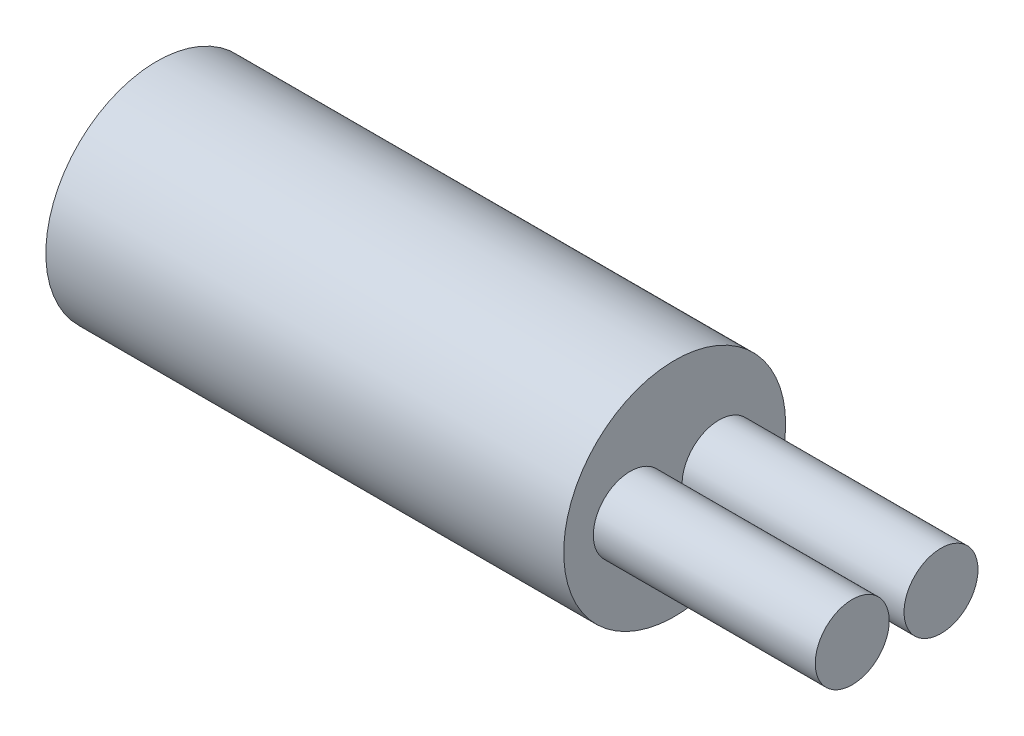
ISO-10303-21;
HEADER;
FILE_DESCRIPTION(('STEP AP214'),'2;1');
FILE_NAME('part.step','',(''),(''),'','','');
FILE_SCHEMA(('AUTOMOTIVE_DESIGN { 1 0 10303 214 1 1 1 1 }'));
ENDSEC;
DATA;
#1=APPLICATION_CONTEXT('core data for automotive mechanical design processes');
#2=APPLICATION_PROTOCOL_DEFINITION('international standard','automotive_design',2000,#1);
#3=PRODUCT_CONTEXT('',#1,'mechanical');
#4=PRODUCT('Part','Part','',(#3));
#5=PRODUCT_RELATED_PRODUCT_CATEGORY('part','',(#4));
#6=PRODUCT_DEFINITION_FORMATION('','',#4);
#7=PRODUCT_DEFINITION_CONTEXT('part definition',#1,'design');
#8=PRODUCT_DEFINITION('design','',#6,#7);
#9=PRODUCT_DEFINITION_SHAPE('','',#8);
#10=(LENGTH_UNIT() NAMED_UNIT(*) SI_UNIT(.MILLI.,.METRE.));
#11=(NAMED_UNIT(*) PLANE_ANGLE_UNIT() SI_UNIT($,.RADIAN.));
#12=(NAMED_UNIT(*) SI_UNIT($,.STERADIAN.) SOLID_ANGLE_UNIT());
#13=UNCERTAINTY_MEASURE_WITH_UNIT(LENGTH_MEASURE(1.E-05),#10,'distance_accuracy_value','');
#14=(GEOMETRIC_REPRESENTATION_CONTEXT(3) GLOBAL_UNCERTAINTY_ASSIGNED_CONTEXT((#13)) GLOBAL_UNIT_ASSIGNED_CONTEXT((#10,
#11,#12)) REPRESENTATION_CONTEXT('',''));
#15=CARTESIAN_POINT('',(0.,0.,0.));
#16=DIRECTION('',(0.,0.,1.));
#17=DIRECTION('',(1.,0.,0.));
#18=AXIS2_PLACEMENT_3D('',#15,#16,#17);
#19=CARTESIAN_POINT('',(-7.,0.,0.));
#20=DIRECTION('',(1.,0.,0.));
#21=DIRECTION('',(0.,0.,-1.));
#22=AXIS2_PLACEMENT_3D('',#19,#20,#21);
#23=CYLINDRICAL_SURFACE('',#22,1.5);
#24=CARTESIAN_POINT('',(-7.,0.,0.));
#25=DIRECTION('',(1.,0.,0.));
#26=DIRECTION('',(0.,0.,-1.));
#27=AXIS2_PLACEMENT_3D('',#24,#25,#26);
#28=CIRCLE('',#27,1.5);
#29=CARTESIAN_POINT('',(-7.,0.,-1.5));
#30=VERTEX_POINT('',#29);
#31=EDGE_CURVE('E41',#30,#30,#28,.T.);
#32=ORIENTED_EDGE('',*,*,#31,.T.);
#33=EDGE_LOOP('',(#32));
#34=FACE_BOUND('',#33,.T.);
#35=CARTESIAN_POINT('',(0.,0.,0.));
#36=DIRECTION('',(1.,0.,0.));
#37=DIRECTION('',(0.,0.,-1.));
#38=AXIS2_PLACEMENT_3D('',#35,#36,#37);
#39=CIRCLE('',#38,1.5);
#40=CARTESIAN_POINT('',(0.,0.,-1.5));
#41=VERTEX_POINT('',#40);
#42=EDGE_CURVE('E37',#41,#41,#39,.T.);
#43=ORIENTED_EDGE('',*,*,#42,.F.);
#44=EDGE_LOOP('',(#43));
#45=FACE_BOUND('',#44,.T.);
#46=ADVANCED_FACE('F34',(#34,#45),#23,.T.);
#47=CARTESIAN_POINT('',(-7.,0.,0.));
#48=DIRECTION('',(1.,0.,0.));
#49=DIRECTION('',(0.,0.,-1.));
#50=AXIS2_PLACEMENT_3D('',#47,#48,#49);
#51=PLANE('',#50);
#52=ORIENTED_EDGE('',*,*,#31,.F.);
#53=EDGE_LOOP('',(#52));
#54=FACE_BOUND('',#53,.T.);
#55=ADVANCED_FACE('F70',(#54),#51,.F.);
#56=CARTESIAN_POINT('',(0.,0.,0.));
#57=DIRECTION('',(1.,0.,0.));
#58=DIRECTION('',(0.,0.,-1.));
#59=AXIS2_PLACEMENT_3D('',#56,#57,#58);
#60=PLANE('',#59);
#61=CARTESIAN_POINT('',(0.,0.,-0.6));
#62=DIRECTION('',(1.,0.,0.));
#63=DIRECTION('',(0.,0.,-1.));
#64=AXIS2_PLACEMENT_3D('',#61,#62,#63);
#65=CIRCLE('',#64,0.5);
#66=CARTESIAN_POINT('',(0.,0.,-1.1));
#67=VERTEX_POINT('',#66);
#68=EDGE_CURVE('E51',#67,#67,#65,.T.);
#69=ORIENTED_EDGE('',*,*,#68,.F.);
#70=EDGE_LOOP('',(#69));
#71=FACE_BOUND('',#70,.T.);
#72=CARTESIAN_POINT('',(0.,0.,0.6));
#73=DIRECTION('',(1.,0.,0.));
#74=DIRECTION('',(0.,0.,-1.));
#75=AXIS2_PLACEMENT_3D('',#72,#73,#74);
#76=CIRCLE('',#75,0.5);
#77=CARTESIAN_POINT('',(0.,0.,0.0999999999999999));
#78=VERTEX_POINT('',#77);
#79=EDGE_CURVE('E10',#78,#78,#76,.T.);
#80=ORIENTED_EDGE('',*,*,#79,.F.);
#81=EDGE_LOOP('',(#80));
#82=FACE_BOUND('',#81,.T.);
#83=ORIENTED_EDGE('',*,*,#42,.T.);
#84=EDGE_LOOP('',(#83));
#85=FACE_BOUND('',#84,.T.);
#86=ADVANCED_FACE('F66',(#71,#82,#85),#60,.T.);
#87=CARTESIAN_POINT('',(3.,0.,0.6));
#88=DIRECTION('',(-1.,0.,0.));
#89=DIRECTION('',(0.,0.,1.));
#90=AXIS2_PLACEMENT_3D('',#87,#88,#89);
#91=CYLINDRICAL_SURFACE('',#90,0.5);
#92=CARTESIAN_POINT('',(3.,0.,0.6));
#93=DIRECTION('',(1.,0.,0.));
#94=DIRECTION('',(0.,0.,-1.));
#95=AXIS2_PLACEMENT_3D('',#92,#93,#94);
#96=CIRCLE('',#95,0.5);
#97=CARTESIAN_POINT('',(3.,0.,0.0999999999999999));
#98=VERTEX_POINT('',#97);
#99=EDGE_CURVE('E47',#98,#98,#96,.T.);
#100=ORIENTED_EDGE('',*,*,#99,.F.);
#101=EDGE_LOOP('',(#100));
#102=FACE_BOUND('',#101,.T.);
#103=ORIENTED_EDGE('',*,*,#79,.T.);
#104=EDGE_LOOP('',(#103));
#105=FACE_BOUND('',#104,.T.);
#106=ADVANCED_FACE('F69',(#102,#105),#91,.T.);
#107=CARTESIAN_POINT('',(3.,0.,0.6));
#108=DIRECTION('',(1.,0.,0.));
#109=DIRECTION('',(0.,0.,-1.));
#110=AXIS2_PLACEMENT_3D('',#107,#108,#109);
#111=PLANE('',#110);
#112=ORIENTED_EDGE('',*,*,#99,.T.);
#113=EDGE_LOOP('',(#112));
#114=FACE_BOUND('',#113,.T.);
#115=ADVANCED_FACE('F62',(#114),#111,.T.);
#116=CARTESIAN_POINT('',(3.,0.,-0.6));
#117=DIRECTION('',(-1.,0.,0.));
#118=DIRECTION('',(0.,0.,1.));
#119=AXIS2_PLACEMENT_3D('',#116,#117,#118);
#120=CYLINDRICAL_SURFACE('',#119,0.5);
#121=CARTESIAN_POINT('',(3.,0.,-0.6));
#122=DIRECTION('',(1.,0.,0.));
#123=DIRECTION('',(0.,0.,-1.));
#124=AXIS2_PLACEMENT_3D('',#121,#122,#123);
#125=CIRCLE('',#124,0.5);
#126=CARTESIAN_POINT('',(3.,0.,-1.1));
#127=VERTEX_POINT('',#126);
#128=EDGE_CURVE('E50',#127,#127,#125,.T.);
#129=ORIENTED_EDGE('',*,*,#128,.F.);
#130=EDGE_LOOP('',(#129));
#131=FACE_BOUND('',#130,.T.);
#132=ORIENTED_EDGE('',*,*,#68,.T.);
#133=EDGE_LOOP('',(#132));
#134=FACE_BOUND('',#133,.T.);
#135=ADVANCED_FACE('F59',(#131,#134),#120,.T.);
#136=CARTESIAN_POINT('',(3.,0.,-0.6));
#137=DIRECTION('',(1.,0.,0.));
#138=DIRECTION('',(0.,0.,-1.));
#139=AXIS2_PLACEMENT_3D('',#136,#137,#138);
#140=PLANE('',#139);
#141=ORIENTED_EDGE('',*,*,#128,.T.);
#142=EDGE_LOOP('',(#141));
#143=FACE_BOUND('',#142,.T.);
#144=ADVANCED_FACE('F57',(#143),#140,.T.);
#145=CLOSED_SHELL('',(#46,#55,#86,#106,#115,#135,#144));
#146=MANIFOLD_SOLID_BREP('B2',#145);
#147=ADVANCED_BREP_SHAPE_REPRESENTATION('',(#18,#146),#14);
#148=SHAPE_DEFINITION_REPRESENTATION(#9,#147);
ENDSEC;
END-ISO-10303-21;
